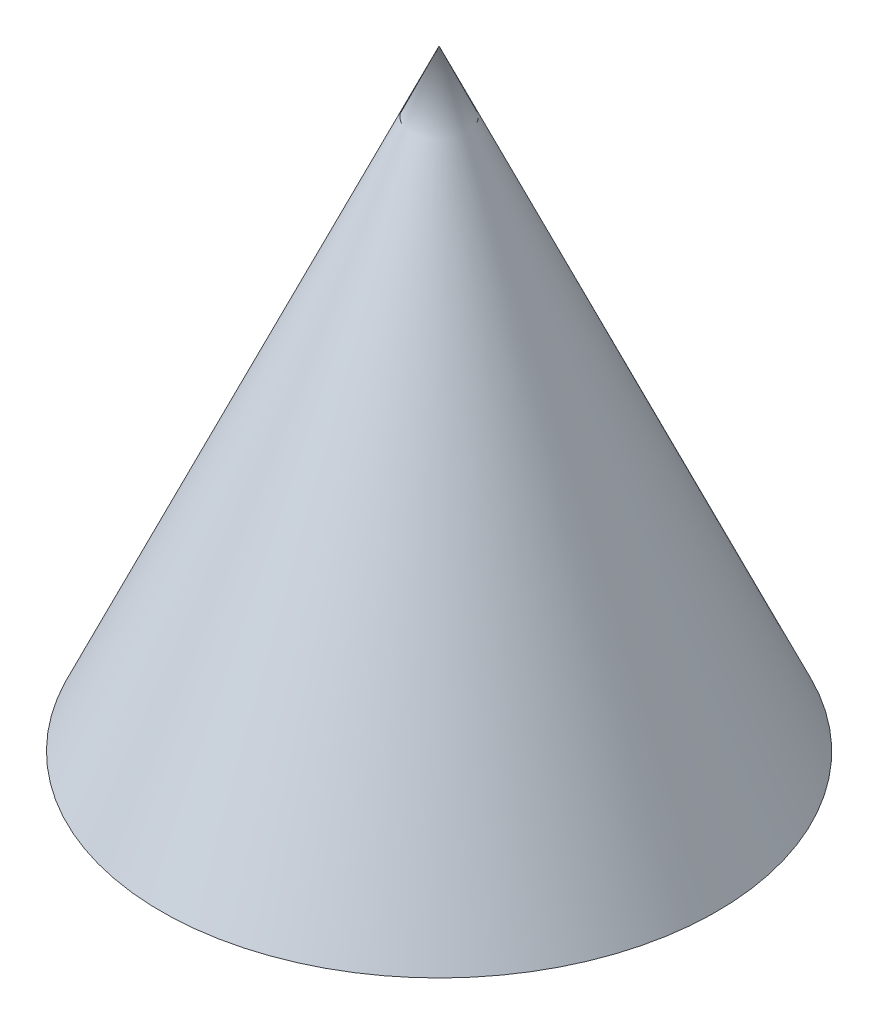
ISO-10303-21;
HEADER;
FILE_DESCRIPTION(('STEP AP214'),'2;1');
FILE_NAME('part.step','',(''),(''),'','','');
FILE_SCHEMA(('AUTOMOTIVE_DESIGN { 1 0 10303 214 1 1 1 1 }'));
ENDSEC;
DATA;
#1=APPLICATION_CONTEXT('core data for automotive mechanical design processes');
#2=APPLICATION_PROTOCOL_DEFINITION('international standard','automotive_design',2000,#1);
#3=PRODUCT_CONTEXT('',#1,'mechanical');
#4=PRODUCT('Part','Part','',(#3));
#5=PRODUCT_RELATED_PRODUCT_CATEGORY('part','',(#4));
#6=PRODUCT_DEFINITION_FORMATION('','',#4);
#7=PRODUCT_DEFINITION_CONTEXT('part definition',#1,'design');
#8=PRODUCT_DEFINITION('design','',#6,#7);
#9=PRODUCT_DEFINITION_SHAPE('','',#8);
#10=(LENGTH_UNIT() NAMED_UNIT(*) SI_UNIT(.MILLI.,.METRE.));
#11=(NAMED_UNIT(*) PLANE_ANGLE_UNIT() SI_UNIT($,.RADIAN.));
#12=(NAMED_UNIT(*) SI_UNIT($,.STERADIAN.) SOLID_ANGLE_UNIT());
#13=UNCERTAINTY_MEASURE_WITH_UNIT(LENGTH_MEASURE(1.E-05),#10,'distance_accuracy_value','');
#14=(GEOMETRIC_REPRESENTATION_CONTEXT(3) GLOBAL_UNCERTAINTY_ASSIGNED_CONTEXT((#13)) GLOBAL_UNIT_ASSIGNED_CONTEXT((#10,
#11,#12)) REPRESENTATION_CONTEXT('',''));
#15=CARTESIAN_POINT('',(0.,0.,0.));
#16=DIRECTION('',(0.,0.,1.));
#17=DIRECTION('',(1.,0.,0.));
#18=AXIS2_PLACEMENT_3D('',#15,#16,#17);
#19=CARTESIAN_POINT('',(0.,0.,0.));
#20=DIRECTION('',(0.,-1.,0.));
#21=DIRECTION('',(0.,0.,-1.));
#22=AXIS2_PLACEMENT_3D('',#19,#20,#21);
#23=CONICAL_SURFACE('',#22,50.,0.426627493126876);
#24=CARTESIAN_POINT('',(0.,110.,0.));
#25=VERTEX_POINT('',#24);
#26=VERTEX_LOOP('',#25);
#27=FACE_BOUND('',#26,.T.);
#28=CARTESIAN_POINT('',(0.,0.,0.));
#29=DIRECTION('',(0.,-1.,0.));
#30=DIRECTION('',(0.,0.,-1.));
#31=AXIS2_PLACEMENT_3D('',#28,#29,#30);
#32=CIRCLE('',#31,50.);
#33=CARTESIAN_POINT('',(0.,0.,-50.));
#34=VERTEX_POINT('',#33);
#35=EDGE_CURVE('E11',#34,#34,#32,.T.);
#36=ORIENTED_EDGE('',*,*,#35,.F.);
#37=EDGE_LOOP('',(#36));
#38=FACE_BOUND('',#37,.T.);
#39=ADVANCED_FACE('F31',(#27,#38),#23,.T.);
#40=CARTESIAN_POINT('',(50.,0.,0.));
#41=DIRECTION('',(0.,-1.,0.));
#42=DIRECTION('',(0.,0.,-1.));
#43=AXIS2_PLACEMENT_3D('',#40,#41,#42);
#44=PLANE('',#43);
#45=CARTESIAN_POINT('',(0.,0.,0.));
#46=DIRECTION('',(0.,-1.,0.));
#47=DIRECTION('',(0.,0.,-1.));
#48=AXIS2_PLACEMENT_3D('',#45,#46,#47);
#49=CIRCLE('',#48,48.9015412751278);
#50=CARTESIAN_POINT('',(0.,0.,-48.9015412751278));
#51=VERTEX_POINT('',#50);
#52=EDGE_CURVE('E38',#51,#51,#49,.T.);
#53=ORIENTED_EDGE('',*,*,#52,.F.);
#54=EDGE_LOOP('',(#53));
#55=FACE_BOUND('',#54,.T.);
#56=ORIENTED_EDGE('',*,*,#35,.T.);
#57=EDGE_LOOP('',(#56));
#58=FACE_BOUND('',#57,.T.);
#59=ADVANCED_FACE('F47',(#55,#58),#44,.T.);
#60=CARTESIAN_POINT('',(0.,-0.413802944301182,0.));
#61=DIRECTION('',(0.,-1.,0.));
#62=DIRECTION('',(0.,0.,-1.));
#63=AXIS2_PLACEMENT_3D('',#60,#61,#62);
#64=CONICAL_SURFACE('',#63,49.0896335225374,0.426627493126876);
#65=CARTESIAN_POINT('',(0.,107.583390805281,0.));
#66=VERTEX_POINT('',#65);
#67=VERTEX_LOOP('',#66);
#68=FACE_BOUND('',#67,.T.);
#69=ORIENTED_EDGE('',*,*,#52,.T.);
#70=EDGE_LOOP('',(#69));
#71=FACE_BOUND('',#70,.T.);
#72=ADVANCED_FACE('F44',(#68,#71),#64,.F.);
#73=CLOSED_SHELL('',(#39,#59,#72));
#74=MANIFOLD_SOLID_BREP('B2',#73);
#75=ADVANCED_BREP_SHAPE_REPRESENTATION('',(#18,#74),#14);
#76=SHAPE_DEFINITION_REPRESENTATION(#9,#75);
ENDSEC;
END-ISO-10303-21;
